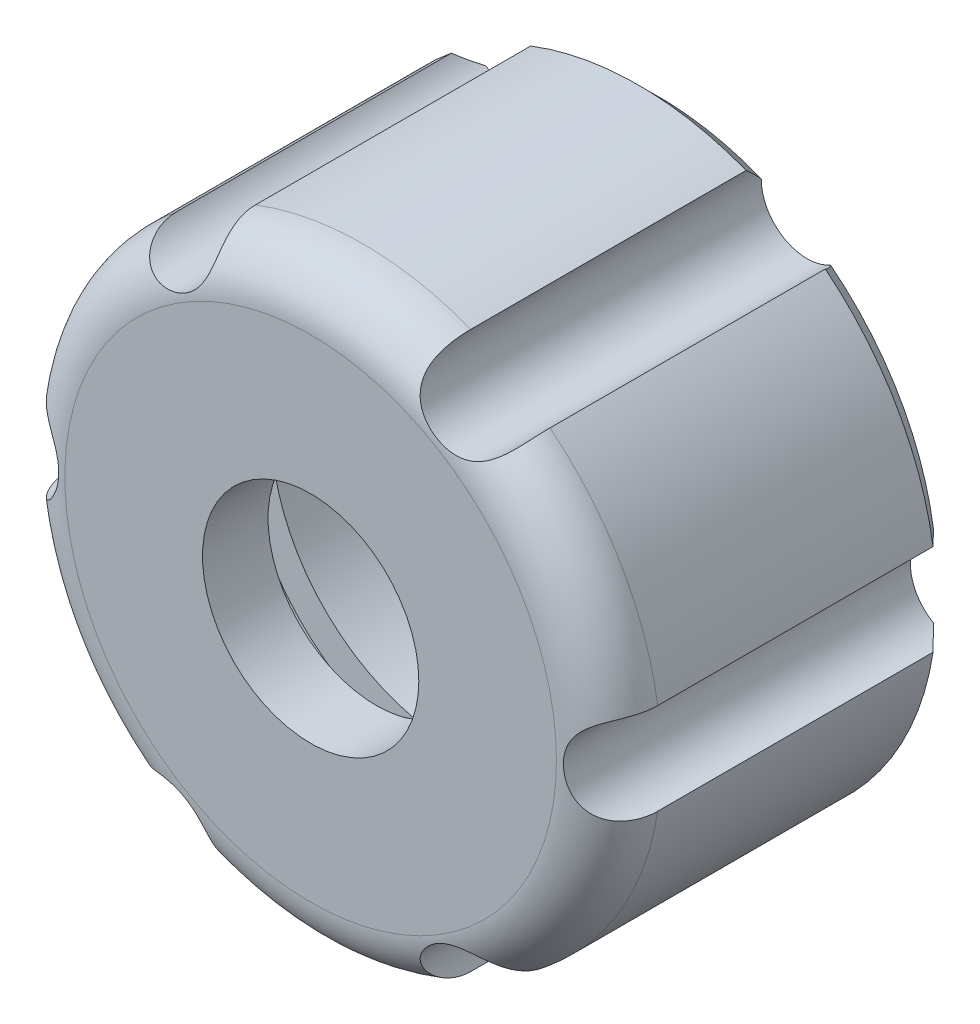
from build123d import *

# Parameters (mm, degrees)
SKETCH_1_R               = 22.75
EXTRUDE_1_DEPTH          = 26.5
CUT_EXTRUDE_START        = -21.5
SKETCH_2_R               = 14
CUT_EXTRUDE_1_DEPTH      = 21.5
SKETCH_3_R               = 16.5
CUT_EXTRUDE_2_DEPTH      = 6
SKETCH_4_R               = 8.25
CUT_EXTRUDE_3_DEPTH      = 42.681830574
FILLET_1_R               = 4
CHAMFER_1_SIZE           = 1.5
SKETCH_5_R               = 3.5
CUT_EXTRUDE_4_DEPTH      = 42.681830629
PATTERN_CIRCULAR_1_COUNT = 6


with BuildPart() as part:
    # Sketch 1 → Extrude 1 (new body)
    with BuildSketch(Plane.XY):
        Circle(SKETCH_1_R)
    extrude(amount=-EXTRUDE_1_DEPTH)

    # Sketch 2 → Cut-Extrude 1 (cut)
    with BuildSketch(Plane(origin=(0, 0, -26.5), x_dir=(-1, 0, 0), z_dir=(0, 0, -1)).offset(CUT_EXTRUDE_START)):
        Circle(SKETCH_2_R)
    extrude(amount=CUT_EXTRUDE_1_DEPTH, mode=Mode.SUBTRACT)

    # Sketch 3 → Cut-Extrude 2 (cut)
    with BuildSketch(Plane.XY.offset(-5)):
        Circle(SKETCH_3_R)
    extrude(amount=-CUT_EXTRUDE_2_DEPTH, mode=Mode.SUBTRACT)

    # Sketch 4 → Cut-Extrude 3 (cut, through all)
    with BuildSketch(Plane.XY):
        Circle(SKETCH_4_R)
    extrude(amount=-CUT_EXTRUDE_3_DEPTH, mode=Mode.SUBTRACT)

    # Fillet 1
    fillet_1_edges = [part.edges().sort_by_distance(p)[0] for p in [
        (-22.75, 0, 0),
    ]]
    fillet(fillet_1_edges, radius=FILLET_1_R)

    # Chamfer 1
    chamfer_1_edges = [part.edges().sort_by_distance(p)[0] for p in [
        (-22.75, 0, -26.5),
    ]]
    chamfer(chamfer_1_edges, length=CHAMFER_1_SIZE)

    # Sketch 5 → Cut-Extrude 4 (cut, through all)
    with BuildSketch(Plane.XY):
        with Locations((22.75, 0)):
            Circle(SKETCH_5_R)
    cut_extrude_4 = extrude(amount=-CUT_EXTRUDE_4_DEPTH, mode=Mode.SUBTRACT)

    # Pattern Circular 1: Cut-Extrude 4 ×6 about axis
    pattern_circular_1_axis = Axis((0, 0, 0), (0, 0, 1))
    for i in range(1, PATTERN_CIRCULAR_1_COUNT):
        add(cut_extrude_4.rotate(pattern_circular_1_axis, i * 360 / PATTERN_CIRCULAR_1_COUNT), mode=Mode.SUBTRACT)


solid = part.part
